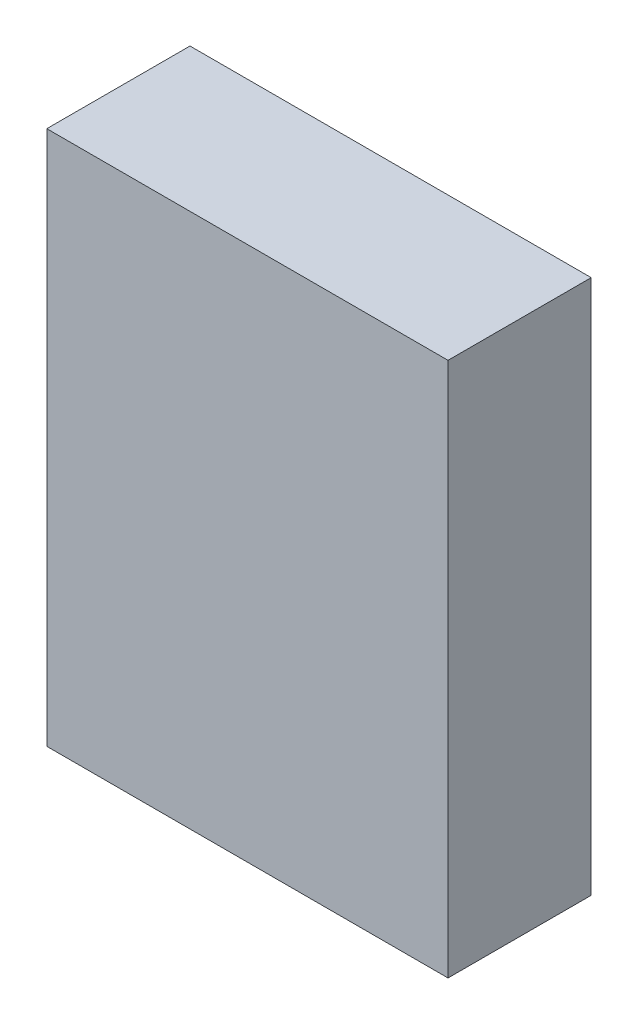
ISO-10303-21;
HEADER;
FILE_DESCRIPTION(('STEP AP214'),'2;1');
FILE_NAME('part.step','',(''),(''),'','','');
FILE_SCHEMA(('AUTOMOTIVE_DESIGN { 1 0 10303 214 1 1 1 1 }'));
ENDSEC;
DATA;
#1=APPLICATION_CONTEXT('core data for automotive mechanical design processes');
#2=APPLICATION_PROTOCOL_DEFINITION('international standard','automotive_design',2000,#1);
#3=PRODUCT_CONTEXT('',#1,'mechanical');
#4=PRODUCT('Part','Part','',(#3));
#5=PRODUCT_RELATED_PRODUCT_CATEGORY('part','',(#4));
#6=PRODUCT_DEFINITION_FORMATION('','',#4);
#7=PRODUCT_DEFINITION_CONTEXT('part definition',#1,'design');
#8=PRODUCT_DEFINITION('design','',#6,#7);
#9=PRODUCT_DEFINITION_SHAPE('','',#8);
#10=(LENGTH_UNIT() NAMED_UNIT(*) SI_UNIT(.MILLI.,.METRE.));
#11=(NAMED_UNIT(*) PLANE_ANGLE_UNIT() SI_UNIT($,.RADIAN.));
#12=(NAMED_UNIT(*) SI_UNIT($,.STERADIAN.) SOLID_ANGLE_UNIT());
#13=UNCERTAINTY_MEASURE_WITH_UNIT(LENGTH_MEASURE(1.E-05),#10,'distance_accuracy_value','');
#14=(GEOMETRIC_REPRESENTATION_CONTEXT(3) GLOBAL_UNCERTAINTY_ASSIGNED_CONTEXT((#13)) GLOBAL_UNIT_ASSIGNED_CONTEXT((#10,
#11,#12)) REPRESENTATION_CONTEXT('',''));
#15=CARTESIAN_POINT('',(0.,0.,0.));
#16=DIRECTION('',(0.,0.,1.));
#17=DIRECTION('',(1.,0.,0.));
#18=AXIS2_PLACEMENT_3D('',#15,#16,#17);
#19=CARTESIAN_POINT('',(1.269999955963E-06,0.,1.06000042));
#20=DIRECTION('',(0.,0.,1.));
#21=DIRECTION('',(1.,0.,0.));
#22=AXIS2_PLACEMENT_3D('',#19,#20,#21);
#23=PLANE('',#22);
#24=DIRECTION('',(0.,1.,0.));
#25=VECTOR('',#24,1.);
#26=CARTESIAN_POINT('',(1.4850999,-1.98010018,1.06000042));
#27=LINE('',#26,#25);
#28=CARTESIAN_POINT('',(1.4850999,-1.98010018,1.06000042));
#29=VERTEX_POINT('',#28);
#30=CARTESIAN_POINT('',(1.4850999,1.98010018,1.06000042));
#31=VERTEX_POINT('',#30);
#32=EDGE_CURVE('E70',#29,#31,#27,.T.);
#33=ORIENTED_EDGE('',*,*,#32,.T.);
#34=DIRECTION('',(-1.,0.,0.));
#35=VECTOR('',#34,1.);
#36=CARTESIAN_POINT('',(1.4850999,1.98010018,1.06000042));
#37=LINE('',#36,#35);
#38=CARTESIAN_POINT('',(-1.48509736,1.98010018,1.06000042));
#39=VERTEX_POINT('',#38);
#40=EDGE_CURVE('E105',#31,#39,#37,.T.);
#41=ORIENTED_EDGE('',*,*,#40,.T.);
#42=DIRECTION('',(0.,-1.,0.));
#43=VECTOR('',#42,1.);
#44=CARTESIAN_POINT('',(-1.48509736,1.98010018,1.06000042));
#45=LINE('',#44,#43);
#46=CARTESIAN_POINT('',(-1.48509736,-1.98010018,1.06000042));
#47=VERTEX_POINT('',#46);
#48=EDGE_CURVE('E72',#39,#47,#45,.T.);
#49=ORIENTED_EDGE('',*,*,#48,.T.);
#50=DIRECTION('',(1.,0.,0.));
#51=VECTOR('',#50,1.);
#52=CARTESIAN_POINT('',(-1.48509736,-1.98010018,1.06000042));
#53=LINE('',#52,#51);
#54=EDGE_CURVE('E11',#47,#29,#53,.T.);
#55=ORIENTED_EDGE('',*,*,#54,.T.);
#56=EDGE_LOOP('',(#33,#41,#49,#55));
#57=FACE_BOUND('',#56,.T.);
#58=ADVANCED_FACE('F17',(#57),#23,.T.);
#59=CARTESIAN_POINT('',(1.269999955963E-06,0.,0.));
#60=DIRECTION('',(0.,0.,1.));
#61=DIRECTION('',(1.,0.,0.));
#62=AXIS2_PLACEMENT_3D('',#59,#60,#61);
#63=PLANE('',#62);
#64=DIRECTION('',(1.,0.,0.));
#65=VECTOR('',#64,1.);
#66=CARTESIAN_POINT('',(-1.48509736,-1.98010018,0.));
#67=LINE('',#66,#65);
#68=CARTESIAN_POINT('',(-1.48509736,-1.98010018,0.));
#69=VERTEX_POINT('',#68);
#70=CARTESIAN_POINT('',(1.4850999,-1.98010018,0.));
#71=VERTEX_POINT('',#70);
#72=EDGE_CURVE('E26',#69,#71,#67,.T.);
#73=ORIENTED_EDGE('',*,*,#72,.F.);
#74=DIRECTION('',(0.,-1.,0.));
#75=VECTOR('',#74,1.);
#76=CARTESIAN_POINT('',(-1.48509736,1.98010018,0.));
#77=LINE('',#76,#75);
#78=CARTESIAN_POINT('',(-1.48509736,1.98010018,0.));
#79=VERTEX_POINT('',#78);
#80=EDGE_CURVE('E108',#79,#69,#77,.T.);
#81=ORIENTED_EDGE('',*,*,#80,.F.);
#82=DIRECTION('',(-1.,0.,0.));
#83=VECTOR('',#82,1.);
#84=CARTESIAN_POINT('',(1.4850999,1.98010018,0.));
#85=LINE('',#84,#83);
#86=CARTESIAN_POINT('',(1.4850999,1.98010018,0.));
#87=VERTEX_POINT('',#86);
#88=EDGE_CURVE('E80',#87,#79,#85,.T.);
#89=ORIENTED_EDGE('',*,*,#88,.F.);
#90=DIRECTION('',(0.,1.,0.));
#91=VECTOR('',#90,1.);
#92=CARTESIAN_POINT('',(1.4850999,-1.98010018,0.));
#93=LINE('',#92,#91);
#94=EDGE_CURVE('E91',#71,#87,#93,.T.);
#95=ORIENTED_EDGE('',*,*,#94,.F.);
#96=EDGE_LOOP('',(#73,#81,#89,#95));
#97=FACE_BOUND('',#96,.T.);
#98=ADVANCED_FACE('F19',(#97),#63,.F.);
#99=CARTESIAN_POINT('',(-1.48509736,-1.98010018,0.));
#100=DIRECTION('',(0.,1.,0.));
#101=DIRECTION('',(1.,0.,0.));
#102=AXIS2_PLACEMENT_3D('',#99,#100,#101);
#103=PLANE('',#102);
#104=ORIENTED_EDGE('',*,*,#72,.T.);
#105=DIRECTION('',(0.,0.,1.));
#106=VECTOR('',#105,1.);
#107=CARTESIAN_POINT('',(1.4850999,-1.98010018,0.));
#108=LINE('',#107,#106);
#109=EDGE_CURVE('E75',#71,#29,#108,.T.);
#110=ORIENTED_EDGE('',*,*,#109,.T.);
#111=ORIENTED_EDGE('',*,*,#54,.F.);
#112=DIRECTION('',(0.,0.,1.));
#113=VECTOR('',#112,1.);
#114=CARTESIAN_POINT('',(-1.48509736,-1.98010018,0.));
#115=LINE('',#114,#113);
#116=EDGE_CURVE('E97',#69,#47,#115,.T.);
#117=ORIENTED_EDGE('',*,*,#116,.F.);
#118=EDGE_LOOP('',(#104,#110,#111,#117));
#119=FACE_BOUND('',#118,.T.);
#120=ADVANCED_FACE('F76',(#119),#103,.F.);
#121=CARTESIAN_POINT('',(-1.48509736,1.98010018,0.));
#122=DIRECTION('',(1.,0.,0.));
#123=DIRECTION('',(0.,1.,0.));
#124=AXIS2_PLACEMENT_3D('',#121,#122,#123);
#125=PLANE('',#124);
#126=ORIENTED_EDGE('',*,*,#80,.T.);
#127=ORIENTED_EDGE('',*,*,#116,.T.);
#128=ORIENTED_EDGE('',*,*,#48,.F.);
#129=DIRECTION('',(0.,0.,1.));
#130=VECTOR('',#129,1.);
#131=CARTESIAN_POINT('',(-1.48509736,1.98010018,0.));
#132=LINE('',#131,#130);
#133=EDGE_CURVE('E101',#79,#39,#132,.T.);
#134=ORIENTED_EDGE('',*,*,#133,.F.);
#135=EDGE_LOOP('',(#126,#127,#128,#134));
#136=FACE_BOUND('',#135,.T.);
#137=ADVANCED_FACE('F162',(#136),#125,.F.);
#138=CARTESIAN_POINT('',(1.4850999,1.98010018,0.));
#139=DIRECTION('',(0.,-1.,0.));
#140=DIRECTION('',(0.,0.,-1.));
#141=AXIS2_PLACEMENT_3D('',#138,#139,#140);
#142=PLANE('',#141);
#143=ORIENTED_EDGE('',*,*,#88,.T.);
#144=ORIENTED_EDGE('',*,*,#133,.T.);
#145=ORIENTED_EDGE('',*,*,#40,.F.);
#146=DIRECTION('',(0.,0.,1.));
#147=VECTOR('',#146,1.);
#148=CARTESIAN_POINT('',(1.4850999,1.98010018,0.));
#149=LINE('',#148,#147);
#150=EDGE_CURVE('E84',#87,#31,#149,.T.);
#151=ORIENTED_EDGE('',*,*,#150,.F.);
#152=EDGE_LOOP('',(#143,#144,#145,#151));
#153=FACE_BOUND('',#152,.T.);
#154=ADVANCED_FACE('F167',(#153),#142,.F.);
#155=CARTESIAN_POINT('',(1.4850999,-1.98010018,0.));
#156=DIRECTION('',(-1.,0.,0.));
#157=DIRECTION('',(0.,0.,1.));
#158=AXIS2_PLACEMENT_3D('',#155,#156,#157);
#159=PLANE('',#158);
#160=ORIENTED_EDGE('',*,*,#94,.T.);
#161=ORIENTED_EDGE('',*,*,#150,.T.);
#162=ORIENTED_EDGE('',*,*,#32,.F.);
#163=ORIENTED_EDGE('',*,*,#109,.F.);
#164=EDGE_LOOP('',(#160,#161,#162,#163));
#165=FACE_BOUND('',#164,.T.);
#166=ADVANCED_FACE('F82',(#165),#159,.F.);
#167=CLOSED_SHELL('',(#58,#98,#120,#137,#154,#166));
#168=MANIFOLD_SOLID_BREP('B1',#167);
#169=ADVANCED_BREP_SHAPE_REPRESENTATION('',(#18,#168),#14);
#170=SHAPE_DEFINITION_REPRESENTATION(#9,#169);
ENDSEC;
END-ISO-10303-21;
